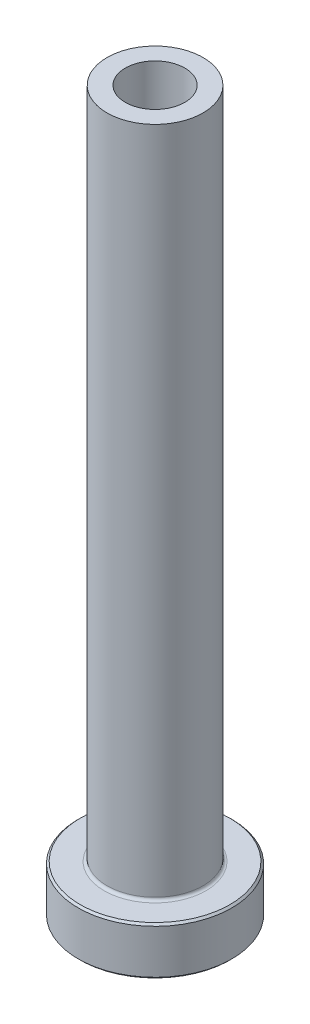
from build123d import *

# Parameters (mm, degrees)
FILLET1_R     = 0.3
CHAMFER1_SIZE = 0.2
CHAMFER3_SIZE = 0.5


with BuildPart() as part:
    # Sketch1 → Revolve1 (revolve)
    with BuildSketch(Plane.XY, mode=Mode.PRIVATE) as revolve1_sk:
        Polygon((-3.1, 75), (-5, 75), (-5, 5), (-8, 5), (-8, 0), (-3.35, 0), (-3.35, 18), (-3.1, 30), align=None)
    revolve(revolve1_sk.sketch.rotate(Axis((0, 92.187680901, 0), (0, -1, 0)), 270), axis=Axis((0, 92.187680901, 0), (0, -1, 0)))

    # Fillet1
    fillet1_edges = [part.edges().sort_by_distance(p)[0] for p in [
        (0, 5, -5),
    ]]
    fillet(fillet1_edges, radius=FILLET1_R)

    # Chamfer1
    chamfer1_edges = [part.edges().sort_by_distance(p)[0] for p in [
        (0, 0, -8),
        (0, 5, -8),
    ]]
    chamfer(chamfer1_edges, length=CHAMFER1_SIZE)

    # Chamfer3
    chamfer3_edges = [part.edges().sort_by_distance(p)[0] for p in [
        (0, 0, -3.35),
    ]]
    chamfer(chamfer3_edges, length=CHAMFER3_SIZE)


solid = part.part
